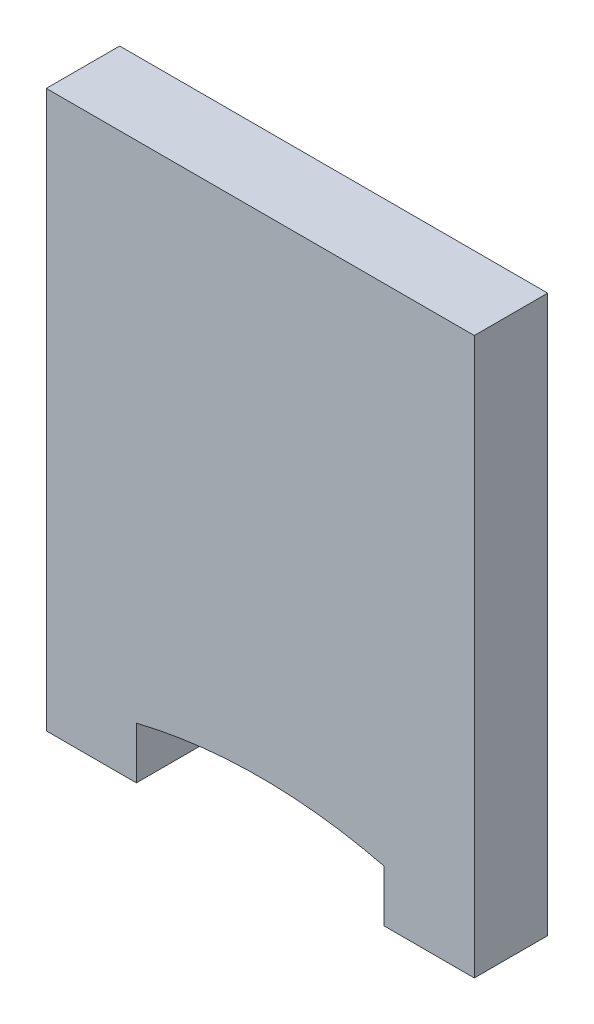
ISO-10303-21;
HEADER;
FILE_DESCRIPTION(('STEP AP214'),'2;1');
FILE_NAME('part.step','',(''),(''),'','','');
FILE_SCHEMA(('AUTOMOTIVE_DESIGN { 1 0 10303 214 1 1 1 1 }'));
ENDSEC;
DATA;
#1=APPLICATION_CONTEXT('core data for automotive mechanical design processes');
#2=APPLICATION_PROTOCOL_DEFINITION('international standard','automotive_design',2000,#1);
#3=PRODUCT_CONTEXT('',#1,'mechanical');
#4=PRODUCT('Part','Part','',(#3));
#5=PRODUCT_RELATED_PRODUCT_CATEGORY('part','',(#4));
#6=PRODUCT_DEFINITION_FORMATION('','',#4);
#7=PRODUCT_DEFINITION_CONTEXT('part definition',#1,'design');
#8=PRODUCT_DEFINITION('design','',#6,#7);
#9=PRODUCT_DEFINITION_SHAPE('','',#8);
#10=(LENGTH_UNIT() NAMED_UNIT(*) SI_UNIT(.MILLI.,.METRE.));
#11=(NAMED_UNIT(*) PLANE_ANGLE_UNIT() SI_UNIT($,.RADIAN.));
#12=(NAMED_UNIT(*) SI_UNIT($,.STERADIAN.) SOLID_ANGLE_UNIT());
#13=UNCERTAINTY_MEASURE_WITH_UNIT(LENGTH_MEASURE(1.E-05),#10,'distance_accuracy_value','');
#14=(GEOMETRIC_REPRESENTATION_CONTEXT(3) GLOBAL_UNCERTAINTY_ASSIGNED_CONTEXT((#13)) GLOBAL_UNIT_ASSIGNED_CONTEXT((#10,
#11,#12)) REPRESENTATION_CONTEXT('',''));
#15=CARTESIAN_POINT('',(0.,0.,0.));
#16=DIRECTION('',(0.,0.,1.));
#17=DIRECTION('',(1.,0.,0.));
#18=AXIS2_PLACEMENT_3D('',#15,#16,#17);
#19=CARTESIAN_POINT('',(2.,5.2,1.186));
#20=DIRECTION('',(0.,0.,1.));
#21=DIRECTION('',(0.,-1.,0.));
#22=AXIS2_PLACEMENT_3D('',#19,#20,#21);
#23=PLANE('',#22);
#24=DIRECTION('',(0.,1.,0.));
#25=VECTOR('',#24,1.);
#26=CARTESIAN_POINT('',(-1.158144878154,0.483747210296,1.186));
#27=LINE('',#26,#25);
#28=CARTESIAN_POINT('',(-1.158144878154,0.,1.186));
#29=VERTEX_POINT('',#28);
#30=CARTESIAN_POINT('',(-1.158144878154,0.483747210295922,1.186));
#31=VERTEX_POINT('',#30);
#32=EDGE_CURVE('E80',#29,#31,#27,.T.);
#33=ORIENTED_EDGE('',*,*,#32,.T.);
#34=CARTESIAN_POINT('',(0.,-4.199649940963,1.186));
#35=DIRECTION('',(0.,0.,1.));
#36=DIRECTION('',(1.,0.,0.));
#37=AXIS2_PLACEMENT_3D('',#34,#35,#36);
#38=CIRCLE('',#37,4.824469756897);
#39=CARTESIAN_POINT('',(1.15814487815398,0.483747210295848,1.186));
#40=VERTEX_POINT('',#39);
#41=EDGE_CURVE('E20',#31,#40,#38,.F.);
#42=ORIENTED_EDGE('',*,*,#41,.T.);
#43=DIRECTION('',(0.,1.,0.));
#44=VECTOR('',#43,1.);
#45=CARTESIAN_POINT('',(1.158144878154,0.,1.186));
#46=LINE('',#45,#44);
#47=CARTESIAN_POINT('',(1.158144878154,0.,1.186));
#48=VERTEX_POINT('',#47);
#49=EDGE_CURVE('E84',#40,#48,#46,.F.);
#50=ORIENTED_EDGE('',*,*,#49,.T.);
#51=DIRECTION('',(1.,0.,0.));
#52=VECTOR('',#51,1.);
#53=CARTESIAN_POINT('',(2.,0.,1.186));
#54=LINE('',#53,#52);
#55=CARTESIAN_POINT('',(2.,0.,1.186));
#56=VERTEX_POINT('',#55);
#57=EDGE_CURVE('E95',#48,#56,#54,.T.);
#58=ORIENTED_EDGE('',*,*,#57,.T.);
#59=DIRECTION('',(0.,1.,0.));
#60=VECTOR('',#59,1.);
#61=CARTESIAN_POINT('',(2.,5.2,1.186));
#62=LINE('',#61,#60);
#63=CARTESIAN_POINT('',(2.,5.2,1.186));
#64=VERTEX_POINT('',#63);
#65=EDGE_CURVE('E109',#64,#56,#62,.F.);
#66=ORIENTED_EDGE('',*,*,#65,.F.);
#67=DIRECTION('',(1.,0.,0.));
#68=VECTOR('',#67,1.);
#69=CARTESIAN_POINT('',(0.,5.2,1.186));
#70=LINE('',#69,#68);
#71=CARTESIAN_POINT('',(-2.,5.2,1.186));
#72=VERTEX_POINT('',#71);
#73=EDGE_CURVE('E149',#64,#72,#70,.F.);
#74=ORIENTED_EDGE('',*,*,#73,.T.);
#75=DIRECTION('',(0.,1.,0.));
#76=VECTOR('',#75,1.);
#77=CARTESIAN_POINT('',(-2.,5.2,1.186));
#78=LINE('',#77,#76);
#79=CARTESIAN_POINT('',(-2.,0.,1.186));
#80=VERTEX_POINT('',#79);
#81=EDGE_CURVE('E151',#80,#72,#78,.T.);
#82=ORIENTED_EDGE('',*,*,#81,.F.);
#83=DIRECTION('',(1.,0.,0.));
#84=VECTOR('',#83,1.);
#85=CARTESIAN_POINT('',(0.,0.,1.186));
#86=LINE('',#85,#84);
#87=EDGE_CURVE('E118',#29,#80,#86,.F.);
#88=ORIENTED_EDGE('',*,*,#87,.F.);
#89=EDGE_LOOP('',(#33,#42,#50,#58,#66,#74,#82,#88));
#90=FACE_BOUND('',#89,.T.);
#91=ADVANCED_FACE('F17',(#90),#23,.T.);
#92=CARTESIAN_POINT('',(1.158144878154,0.,-0.001));
#93=DIRECTION('',(1.,0.,0.));
#94=DIRECTION('',(0.,0.,-1.));
#95=AXIS2_PLACEMENT_3D('',#92,#93,#94);
#96=PLANE('',#95);
#97=ORIENTED_EDGE('',*,*,#49,.F.);
#98=DIRECTION('',(0.,0.,1.));
#99=VECTOR('',#98,1.);
#100=CARTESIAN_POINT('',(1.15814487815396,0.483747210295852,-0.001));
#101=LINE('',#100,#99);
#102=CARTESIAN_POINT('',(1.15814487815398,0.483747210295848,0.5));
#103=VERTEX_POINT('',#102);
#104=EDGE_CURVE('E89',#40,#103,#101,.F.);
#105=ORIENTED_EDGE('',*,*,#104,.T.);
#106=DIRECTION('',(0.,1.,0.));
#107=VECTOR('',#106,1.);
#108=CARTESIAN_POINT('',(1.158144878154,5.2,0.5));
#109=LINE('',#108,#107);
#110=CARTESIAN_POINT('',(1.158144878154,0.,0.5));
#111=VERTEX_POINT('',#110);
#112=EDGE_CURVE('E132',#111,#103,#109,.T.);
#113=ORIENTED_EDGE('',*,*,#112,.F.);
#114=DIRECTION('',(0.,0.,-1.));
#115=VECTOR('',#114,1.);
#116=CARTESIAN_POINT('',(1.158144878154,0.,0.843));
#117=LINE('',#116,#115);
#118=EDGE_CURVE('E94',#48,#111,#117,.T.);
#119=ORIENTED_EDGE('',*,*,#118,.F.);
#120=EDGE_LOOP('',(#97,#105,#113,#119));
#121=FACE_BOUND('',#120,.T.);
#122=ADVANCED_FACE('F91',(#121),#96,.F.);
#123=CARTESIAN_POINT('',(0.,-4.199649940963,-0.001));
#124=DIRECTION('',(0.,0.,1.));
#125=DIRECTION('',(1.,0.,0.));
#126=AXIS2_PLACEMENT_3D('',#123,#124,#125);
#127=CYLINDRICAL_SURFACE('',#126,4.824469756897);
#128=ORIENTED_EDGE('',*,*,#41,.F.);
#129=DIRECTION('',(0.,0.,1.));
#130=VECTOR('',#129,1.);
#131=CARTESIAN_POINT('',(-1.158144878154,0.483747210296,-0.001));
#132=LINE('',#131,#130);
#133=CARTESIAN_POINT('',(-1.158144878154,0.483747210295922,0.5));
#134=VERTEX_POINT('',#133);
#135=EDGE_CURVE('E102',#31,#134,#132,.F.);
#136=ORIENTED_EDGE('',*,*,#135,.T.);
#137=CARTESIAN_POINT('',(0.,-4.199649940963,0.5));
#138=DIRECTION('',(0.,0.,1.));
#139=DIRECTION('',(1.,0.,0.));
#140=AXIS2_PLACEMENT_3D('',#137,#138,#139);
#141=CIRCLE('',#140,4.824469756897);
#142=EDGE_CURVE('E99',#103,#134,#141,.T.);
#143=ORIENTED_EDGE('',*,*,#142,.F.);
#144=ORIENTED_EDGE('',*,*,#104,.F.);
#145=EDGE_LOOP('',(#128,#136,#143,#144));
#146=FACE_BOUND('',#145,.T.);
#147=ADVANCED_FACE('F97',(#146),#127,.F.);
#148=CARTESIAN_POINT('',(-1.158144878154,0.483747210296,-0.001));
#149=DIRECTION('',(-1.,0.,0.));
#150=DIRECTION('',(0.,0.,1.));
#151=AXIS2_PLACEMENT_3D('',#148,#149,#150);
#152=PLANE('',#151);
#153=ORIENTED_EDGE('',*,*,#32,.F.);
#154=DIRECTION('',(0.,0.,-1.));
#155=VECTOR('',#154,1.);
#156=CARTESIAN_POINT('',(-1.158144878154,0.,0.843));
#157=LINE('',#156,#155);
#158=CARTESIAN_POINT('',(-1.158144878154,0.,0.5));
#159=VERTEX_POINT('',#158);
#160=EDGE_CURVE('E121',#159,#29,#157,.F.);
#161=ORIENTED_EDGE('',*,*,#160,.F.);
#162=DIRECTION('',(0.,1.,0.));
#163=VECTOR('',#162,1.);
#164=CARTESIAN_POINT('',(-1.158144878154,5.2,0.5));
#165=LINE('',#164,#163);
#166=EDGE_CURVE('E134',#134,#159,#165,.F.);
#167=ORIENTED_EDGE('',*,*,#166,.F.);
#168=ORIENTED_EDGE('',*,*,#135,.F.);
#169=EDGE_LOOP('',(#153,#161,#167,#168));
#170=FACE_BOUND('',#169,.T.);
#171=ADVANCED_FACE('F168',(#170),#152,.F.);
#172=CARTESIAN_POINT('',(0.,0.,0.843));
#173=DIRECTION('',(0.,-1.,0.));
#174=DIRECTION('',(0.,0.,-1.));
#175=AXIS2_PLACEMENT_3D('',#172,#173,#174);
#176=PLANE('',#175);
#177=DIRECTION('',(0.,0.,1.));
#178=VECTOR('',#177,1.);
#179=CARTESIAN_POINT('',(-2.,0.,1.186));
#180=LINE('',#179,#178);
#181=CARTESIAN_POINT('',(-2.,0.,0.5));
#182=VERTEX_POINT('',#181);
#183=EDGE_CURVE('E120',#182,#80,#180,.T.);
#184=ORIENTED_EDGE('',*,*,#183,.F.);
#185=DIRECTION('',(-1.,0.,0.));
#186=VECTOR('',#185,1.);
#187=CARTESIAN_POINT('',(-2.,0.,0.5));
#188=LINE('',#187,#186);
#189=EDGE_CURVE('E137',#159,#182,#188,.T.);
#190=ORIENTED_EDGE('',*,*,#189,.F.);
#191=ORIENTED_EDGE('',*,*,#160,.T.);
#192=ORIENTED_EDGE('',*,*,#87,.T.);
#193=EDGE_LOOP('',(#184,#190,#191,#192));
#194=FACE_BOUND('',#193,.T.);
#195=ADVANCED_FACE('F164',(#194),#176,.T.);
#196=CARTESIAN_POINT('',(-2.,5.2,1.186));
#197=DIRECTION('',(-1.,0.,0.));
#198=DIRECTION('',(0.,0.,1.));
#199=AXIS2_PLACEMENT_3D('',#196,#197,#198);
#200=PLANE('',#199);
#201=DIRECTION('',(0.,0.,-1.));
#202=VECTOR('',#201,1.);
#203=CARTESIAN_POINT('',(-2.,5.2,0.843));
#204=LINE('',#203,#202);
#205=CARTESIAN_POINT('',(-2.,5.2,0.5));
#206=VERTEX_POINT('',#205);
#207=EDGE_CURVE('E147',#72,#206,#204,.T.);
#208=ORIENTED_EDGE('',*,*,#207,.T.);
#209=DIRECTION('',(0.,1.,0.));
#210=VECTOR('',#209,1.);
#211=CARTESIAN_POINT('',(-2.,5.2,0.5));
#212=LINE('',#211,#210);
#213=EDGE_CURVE('E159',#182,#206,#212,.T.);
#214=ORIENTED_EDGE('',*,*,#213,.F.);
#215=ORIENTED_EDGE('',*,*,#183,.T.);
#216=ORIENTED_EDGE('',*,*,#81,.T.);
#217=EDGE_LOOP('',(#208,#214,#215,#216));
#218=FACE_BOUND('',#217,.T.);
#219=ADVANCED_FACE('F173',(#218),#200,.T.);
#220=CARTESIAN_POINT('',(0.,5.2,0.843));
#221=DIRECTION('',(0.,-1.,0.));
#222=DIRECTION('',(0.,0.,-1.));
#223=AXIS2_PLACEMENT_3D('',#220,#221,#222);
#224=PLANE('',#223);
#225=DIRECTION('',(-1.,0.,0.));
#226=VECTOR('',#225,1.);
#227=CARTESIAN_POINT('',(-2.,5.2,0.5));
#228=LINE('',#227,#226);
#229=CARTESIAN_POINT('',(2.,5.2,0.5));
#230=VERTEX_POINT('',#229);
#231=EDGE_CURVE('E177',#206,#230,#228,.F.);
#232=ORIENTED_EDGE('',*,*,#231,.F.);
#233=ORIENTED_EDGE('',*,*,#207,.F.);
#234=ORIENTED_EDGE('',*,*,#73,.F.);
#235=DIRECTION('',(0.,0.,-1.));
#236=VECTOR('',#235,1.);
#237=CARTESIAN_POINT('',(2.,5.2,0.5));
#238=LINE('',#237,#236);
#239=EDGE_CURVE('E128',#230,#64,#238,.F.);
#240=ORIENTED_EDGE('',*,*,#239,.F.);
#241=EDGE_LOOP('',(#232,#233,#234,#240));
#242=FACE_BOUND('',#241,.T.);
#243=ADVANCED_FACE('F194',(#242),#224,.F.);
#244=CARTESIAN_POINT('',(2.,5.2,0.5));
#245=DIRECTION('',(1.,0.,0.));
#246=DIRECTION('',(0.,0.,-1.));
#247=AXIS2_PLACEMENT_3D('',#244,#245,#246);
#248=PLANE('',#247);
#249=ORIENTED_EDGE('',*,*,#239,.T.);
#250=ORIENTED_EDGE('',*,*,#65,.T.);
#251=DIRECTION('',(0.,0.,-1.));
#252=VECTOR('',#251,1.);
#253=CARTESIAN_POINT('',(2.,0.,0.843));
#254=LINE('',#253,#252);
#255=CARTESIAN_POINT('',(2.,0.,0.5));
#256=VERTEX_POINT('',#255);
#257=EDGE_CURVE('E35',#256,#56,#254,.F.);
#258=ORIENTED_EDGE('',*,*,#257,.F.);
#259=DIRECTION('',(0.,1.,0.));
#260=VECTOR('',#259,1.);
#261=CARTESIAN_POINT('',(2.,5.2,0.5));
#262=LINE('',#261,#260);
#263=EDGE_CURVE('E26',#230,#256,#262,.F.);
#264=ORIENTED_EDGE('',*,*,#263,.F.);
#265=EDGE_LOOP('',(#249,#250,#258,#264));
#266=FACE_BOUND('',#265,.T.);
#267=ADVANCED_FACE('F188',(#266),#248,.T.);
#268=CARTESIAN_POINT('',(0.,0.,0.843));
#269=DIRECTION('',(0.,-1.,0.));
#270=DIRECTION('',(0.,0.,-1.));
#271=AXIS2_PLACEMENT_3D('',#268,#269,#270);
#272=PLANE('',#271);
#273=ORIENTED_EDGE('',*,*,#257,.T.);
#274=ORIENTED_EDGE('',*,*,#57,.F.);
#275=ORIENTED_EDGE('',*,*,#118,.T.);
#276=DIRECTION('',(-1.,0.,0.));
#277=VECTOR('',#276,1.);
#278=CARTESIAN_POINT('',(-2.,0.,0.5));
#279=LINE('',#278,#277);
#280=EDGE_CURVE('E11',#256,#111,#279,.T.);
#281=ORIENTED_EDGE('',*,*,#280,.F.);
#282=EDGE_LOOP('',(#273,#274,#275,#281));
#283=FACE_BOUND('',#282,.T.);
#284=ADVANCED_FACE('F182',(#283),#272,.T.);
#285=CARTESIAN_POINT('',(-2.,5.2,0.5));
#286=DIRECTION('',(0.,0.,-1.));
#287=DIRECTION('',(-1.,0.,0.));
#288=AXIS2_PLACEMENT_3D('',#285,#286,#287);
#289=PLANE('',#288);
#290=ORIENTED_EDGE('',*,*,#263,.T.);
#291=ORIENTED_EDGE('',*,*,#280,.T.);
#292=ORIENTED_EDGE('',*,*,#112,.T.);
#293=ORIENTED_EDGE('',*,*,#142,.T.);
#294=ORIENTED_EDGE('',*,*,#166,.T.);
#295=ORIENTED_EDGE('',*,*,#189,.T.);
#296=ORIENTED_EDGE('',*,*,#213,.T.);
#297=ORIENTED_EDGE('',*,*,#231,.T.);
#298=EDGE_LOOP('',(#290,#291,#292,#293,#294,#295,#296,#297));
#299=FACE_BOUND('',#298,.T.);
#300=ADVANCED_FACE('F180',(#299),#289,.T.);
#301=CLOSED_SHELL('',(#91,#122,#147,#171,#195,#219,#243,#267,#284,#300));
#302=MANIFOLD_SOLID_BREP('B1',#301);
#303=ADVANCED_BREP_SHAPE_REPRESENTATION('',(#18,#302),#14);
#304=SHAPE_DEFINITION_REPRESENTATION(#9,#303);
ENDSEC;
END-ISO-10303-21;
